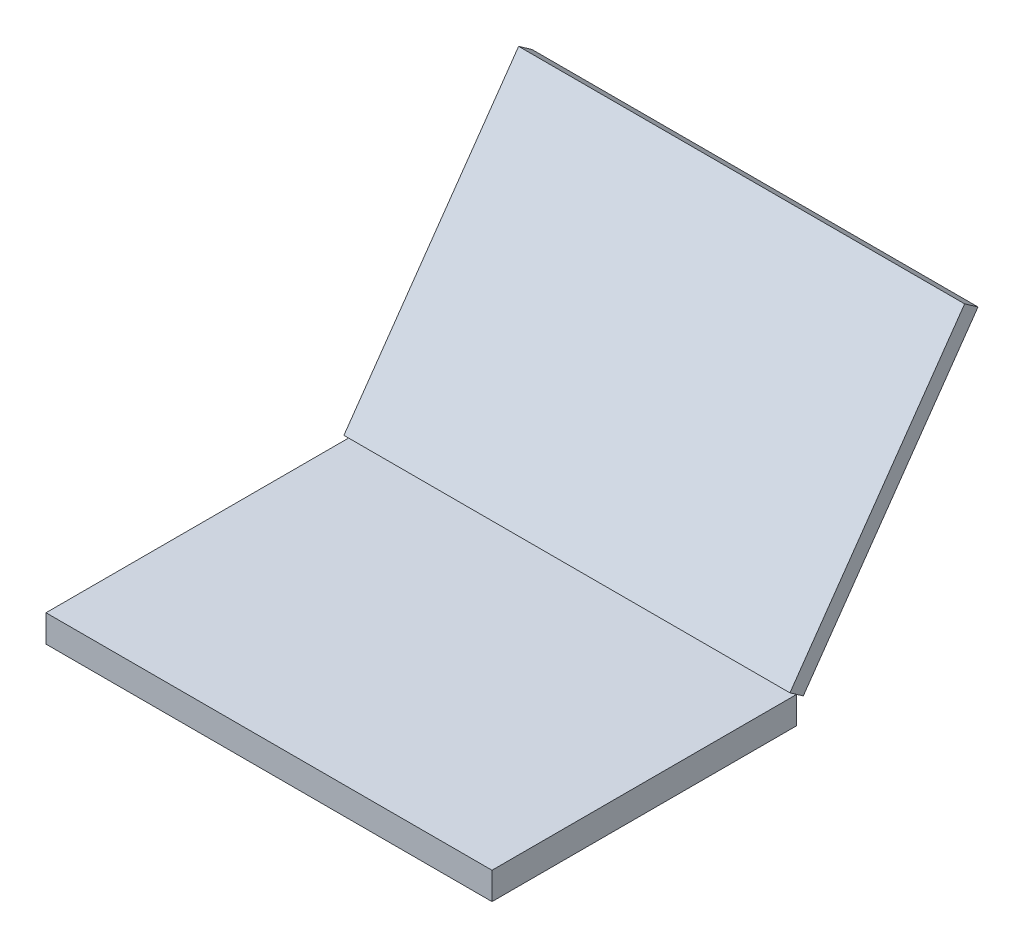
ISO-10303-21;
HEADER;
FILE_DESCRIPTION(('STEP AP214'),'2;1');
FILE_NAME('part.step','',(''),(''),'','','');
FILE_SCHEMA(('AUTOMOTIVE_DESIGN { 1 0 10303 214 1 1 1 1 }'));
ENDSEC;
DATA;
#1=APPLICATION_CONTEXT('core data for automotive mechanical design processes');
#2=APPLICATION_PROTOCOL_DEFINITION('international standard','automotive_design',2000,#1);
#3=PRODUCT_CONTEXT('',#1,'mechanical');
#4=PRODUCT('Part','Part','',(#3));
#5=PRODUCT_RELATED_PRODUCT_CATEGORY('part','',(#4));
#6=PRODUCT_DEFINITION_FORMATION('','',#4);
#7=PRODUCT_DEFINITION_CONTEXT('part definition',#1,'design');
#8=PRODUCT_DEFINITION('design','',#6,#7);
#9=PRODUCT_DEFINITION_SHAPE('','',#8);
#10=(LENGTH_UNIT() NAMED_UNIT(*) SI_UNIT(.MILLI.,.METRE.));
#11=(NAMED_UNIT(*) PLANE_ANGLE_UNIT() SI_UNIT($,.RADIAN.));
#12=(NAMED_UNIT(*) SI_UNIT($,.STERADIAN.) SOLID_ANGLE_UNIT());
#13=UNCERTAINTY_MEASURE_WITH_UNIT(LENGTH_MEASURE(1.E-05),#10,'distance_accuracy_value','');
#14=(GEOMETRIC_REPRESENTATION_CONTEXT(3) GLOBAL_UNCERTAINTY_ASSIGNED_CONTEXT((#13)) GLOBAL_UNIT_ASSIGNED_CONTEXT((#10,
#11,#12)) REPRESENTATION_CONTEXT('',''));
#15=CARTESIAN_POINT('',(0.,0.,0.));
#16=DIRECTION('',(0.,0.,1.));
#17=DIRECTION('',(1.,0.,0.));
#18=AXIS2_PLACEMENT_3D('',#15,#16,#17);
#19=CARTESIAN_POINT('',(-205.,8.1981767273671,-146.143640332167));
#20=DIRECTION('',(1.,0.,0.));
#21=DIRECTION('',(0.,0.,-1.));
#22=AXIS2_PLACEMENT_3D('',#19,#20,#21);
#23=PLANE('',#22);
#24=DIRECTION('',(0.,0.819152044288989,-0.57357643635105));
#25=VECTOR('',#24,1.);
#26=CARTESIAN_POINT('',(-205.,16.8018232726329,-133.856359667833));
#27=LINE('',#26,#25);
#28=CARTESIAN_POINT('',(-205.,16.8018232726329,-133.856359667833));
#29=VERTEX_POINT('',#28);
#30=CARTESIAN_POINT('',(-205.,246.16439567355,-294.457761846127));
#31=VERTEX_POINT('',#30);
#32=EDGE_CURVE('E106',#29,#31,#27,.T.);
#33=ORIENTED_EDGE('',*,*,#32,.T.);
#34=DIRECTION('',(0.,0.57357643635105,0.819152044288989));
#35=VECTOR('',#34,1.);
#36=CARTESIAN_POINT('',(-205.,237.560749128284,-306.745042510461));
#37=LINE('',#36,#35);
#38=CARTESIAN_POINT('',(-205.,237.560749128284,-306.745042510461));
#39=VERTEX_POINT('',#38);
#40=EDGE_CURVE('E12',#39,#31,#37,.T.);
#41=ORIENTED_EDGE('',*,*,#40,.F.);
#42=DIRECTION('',(0.,0.819152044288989,-0.57357643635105));
#43=VECTOR('',#42,1.);
#44=CARTESIAN_POINT('',(-205.,8.1981767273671,-146.143640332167));
#45=LINE('',#44,#43);
#46=CARTESIAN_POINT('',(-205.,8.1981767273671,-146.143640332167));
#47=VERTEX_POINT('',#46);
#48=EDGE_CURVE('E94',#47,#39,#45,.T.);
#49=ORIENTED_EDGE('',*,*,#48,.F.);
#50=DIRECTION('',(0.,0.57357643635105,0.819152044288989));
#51=VECTOR('',#50,1.);
#52=CARTESIAN_POINT('',(-205.,8.1981767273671,-146.143640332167));
#53=LINE('',#52,#51);
#54=EDGE_CURVE('E102',#47,#29,#53,.T.);
#55=ORIENTED_EDGE('',*,*,#54,.T.);
#56=EDGE_LOOP('',(#33,#41,#49,#55));
#57=FACE_BOUND('',#56,.T.);
#58=ADVANCED_FACE('F43',(#57),#23,.F.);
#59=CARTESIAN_POINT('',(-205.,237.560749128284,-306.745042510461));
#60=DIRECTION('',(0.,-0.819152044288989,0.57357643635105));
#61=DIRECTION('',(0.,-0.57357643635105,-0.819152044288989));
#62=AXIS2_PLACEMENT_3D('',#59,#60,#61);
#63=PLANE('',#62);
#64=DIRECTION('',(1.,0.,0.));
#65=VECTOR('',#64,1.);
#66=CARTESIAN_POINT('',(-205.,246.16439567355,-294.457761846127));
#67=LINE('',#66,#65);
#68=CARTESIAN_POINT('',(205.,246.16439567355,-294.457761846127));
#69=VERTEX_POINT('',#68);
#70=EDGE_CURVE('E98',#31,#69,#67,.T.);
#71=ORIENTED_EDGE('',*,*,#70,.T.);
#72=DIRECTION('',(0.,0.57357643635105,0.819152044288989));
#73=VECTOR('',#72,1.);
#74=CARTESIAN_POINT('',(205.,237.560749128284,-306.745042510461));
#75=LINE('',#74,#73);
#76=CARTESIAN_POINT('',(205.,237.560749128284,-306.745042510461));
#77=VERTEX_POINT('',#76);
#78=EDGE_CURVE('E51',#77,#69,#75,.T.);
#79=ORIENTED_EDGE('',*,*,#78,.F.);
#80=DIRECTION('',(1.,0.,0.));
#81=VECTOR('',#80,1.);
#82=CARTESIAN_POINT('',(-205.,237.560749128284,-306.745042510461));
#83=LINE('',#82,#81);
#84=EDGE_CURVE('E89',#39,#77,#83,.T.);
#85=ORIENTED_EDGE('',*,*,#84,.F.);
#86=ORIENTED_EDGE('',*,*,#40,.T.);
#87=EDGE_LOOP('',(#71,#79,#85,#86));
#88=FACE_BOUND('',#87,.T.);
#89=ADVANCED_FACE('F97',(#88),#63,.F.);
#90=CARTESIAN_POINT('',(205.,8.1981767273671,-146.143640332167));
#91=DIRECTION('',(-1.,0.,0.));
#92=DIRECTION('',(0.,-1.,0.));
#93=AXIS2_PLACEMENT_3D('',#90,#91,#92);
#94=PLANE('',#93);
#95=DIRECTION('',(0.,-0.819152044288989,0.57357643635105));
#96=VECTOR('',#95,1.);
#97=CARTESIAN_POINT('',(205.,16.8018232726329,-133.856359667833));
#98=LINE('',#97,#96);
#99=CARTESIAN_POINT('',(205.,16.8018232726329,-133.856359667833));
#100=VERTEX_POINT('',#99);
#101=EDGE_CURVE('E76',#69,#100,#98,.T.);
#102=ORIENTED_EDGE('',*,*,#101,.T.);
#103=DIRECTION('',(0.,0.57357643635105,0.819152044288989));
#104=VECTOR('',#103,1.);
#105=CARTESIAN_POINT('',(205.,8.1981767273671,-146.143640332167));
#106=LINE('',#105,#104);
#107=CARTESIAN_POINT('',(205.,8.1981767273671,-146.143640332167));
#108=VERTEX_POINT('',#107);
#109=EDGE_CURVE('E99',#108,#100,#106,.T.);
#110=ORIENTED_EDGE('',*,*,#109,.F.);
#111=DIRECTION('',(0.,-0.819152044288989,0.57357643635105));
#112=VECTOR('',#111,1.);
#113=CARTESIAN_POINT('',(205.,8.1981767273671,-146.143640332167));
#114=LINE('',#113,#112);
#115=EDGE_CURVE('E92',#77,#108,#114,.T.);
#116=ORIENTED_EDGE('',*,*,#115,.F.);
#117=ORIENTED_EDGE('',*,*,#78,.T.);
#118=EDGE_LOOP('',(#102,#110,#116,#117));
#119=FACE_BOUND('',#118,.T.);
#120=ADVANCED_FACE('F100',(#119),#94,.F.);
#121=CARTESIAN_POINT('',(-205.,8.1981767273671,-146.143640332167));
#122=DIRECTION('',(0.,0.819152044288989,-0.57357643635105));
#123=DIRECTION('',(0.,0.57357643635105,0.819152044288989));
#124=AXIS2_PLACEMENT_3D('',#121,#122,#123);
#125=PLANE('',#124);
#126=DIRECTION('',(-1.,0.,0.));
#127=VECTOR('',#126,1.);
#128=CARTESIAN_POINT('',(-205.,16.8018232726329,-133.856359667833));
#129=LINE('',#128,#127);
#130=EDGE_CURVE('E82',#100,#29,#129,.T.);
#131=ORIENTED_EDGE('',*,*,#130,.T.);
#132=ORIENTED_EDGE('',*,*,#54,.F.);
#133=DIRECTION('',(-1.,0.,0.));
#134=VECTOR('',#133,1.);
#135=CARTESIAN_POINT('',(-205.,8.1981767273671,-146.143640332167));
#136=LINE('',#135,#134);
#137=EDGE_CURVE('E59',#108,#47,#136,.T.);
#138=ORIENTED_EDGE('',*,*,#137,.F.);
#139=ORIENTED_EDGE('',*,*,#109,.T.);
#140=EDGE_LOOP('',(#131,#132,#138,#139));
#141=FACE_BOUND('',#140,.T.);
#142=ADVANCED_FACE('F113',(#141),#125,.F.);
#143=CARTESIAN_POINT('',(0.,-65.9679326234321,-94.2119714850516));
#144=DIRECTION('',(0.,-0.57357643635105,-0.819152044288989));
#145=DIRECTION('',(0.,0.819152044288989,-0.57357643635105));
#146=AXIS2_PLACEMENT_3D('',#143,#144,#145);
#147=PLANE('',#146);
#148=ORIENTED_EDGE('',*,*,#48,.T.);
#149=ORIENTED_EDGE('',*,*,#84,.T.);
#150=ORIENTED_EDGE('',*,*,#115,.T.);
#151=ORIENTED_EDGE('',*,*,#137,.T.);
#152=EDGE_LOOP('',(#148,#149,#150,#151));
#153=FACE_BOUND('',#152,.T.);
#154=ADVANCED_FACE('F90',(#153),#147,.T.);
#155=CARTESIAN_POINT('',(0.,-57.3642860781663,-81.9246908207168));
#156=DIRECTION('',(0.,-0.57357643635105,-0.819152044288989));
#157=DIRECTION('',(0.,0.819152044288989,-0.57357643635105));
#158=AXIS2_PLACEMENT_3D('',#155,#156,#157);
#159=PLANE('',#158);
#160=ORIENTED_EDGE('',*,*,#32,.F.);
#161=ORIENTED_EDGE('',*,*,#130,.F.);
#162=ORIENTED_EDGE('',*,*,#101,.F.);
#163=ORIENTED_EDGE('',*,*,#70,.F.);
#164=EDGE_LOOP('',(#160,#161,#162,#163));
#165=FACE_BOUND('',#164,.T.);
#166=ADVANCED_FACE('F116',(#165),#159,.F.);
#167=CLOSED_SHELL('',(#58,#89,#120,#142,#154,#166));
#168=MANIFOLD_SOLID_BREP('B2',#167);
#169=CARTESIAN_POINT('',(205.,12.5,140.));
#170=DIRECTION('',(-1.,0.,0.));
#171=DIRECTION('',(0.,0.,1.));
#172=AXIS2_PLACEMENT_3D('',#169,#170,#171);
#173=PLANE('',#172);
#174=DIRECTION('',(0.,0.,-1.));
#175=VECTOR('',#174,1.);
#176=CARTESIAN_POINT('',(205.,-12.5,140.));
#177=LINE('',#176,#175);
#178=CARTESIAN_POINT('',(205.,-12.5,140.));
#179=VERTEX_POINT('',#178);
#180=CARTESIAN_POINT('',(205.,-12.5,-140.));
#181=VERTEX_POINT('',#180);
#182=EDGE_CURVE('E230',#179,#181,#177,.T.);
#183=ORIENTED_EDGE('',*,*,#182,.T.);
#184=DIRECTION('',(0.,-1.,0.));
#185=VECTOR('',#184,1.);
#186=CARTESIAN_POINT('',(205.,12.5,-140.));
#187=LINE('',#186,#185);
#188=CARTESIAN_POINT('',(205.,12.5,-140.));
#189=VERTEX_POINT('',#188);
#190=EDGE_CURVE('E41',#189,#181,#187,.T.);
#191=ORIENTED_EDGE('',*,*,#190,.F.);
#192=DIRECTION('',(0.,0.,-1.));
#193=VECTOR('',#192,1.);
#194=CARTESIAN_POINT('',(205.,12.5,140.));
#195=LINE('',#194,#193);
#196=CARTESIAN_POINT('',(205.,12.5,140.));
#197=VERTEX_POINT('',#196);
#198=EDGE_CURVE('E218',#197,#189,#195,.T.);
#199=ORIENTED_EDGE('',*,*,#198,.F.);
#200=DIRECTION('',(0.,-1.,0.));
#201=VECTOR('',#200,1.);
#202=CARTESIAN_POINT('',(205.,12.5,140.));
#203=LINE('',#202,#201);
#204=EDGE_CURVE('E226',#197,#179,#203,.T.);
#205=ORIENTED_EDGE('',*,*,#204,.T.);
#206=EDGE_LOOP('',(#183,#191,#199,#205));
#207=FACE_BOUND('',#206,.T.);
#208=ADVANCED_FACE('F167',(#207),#173,.F.);
#209=CARTESIAN_POINT('',(-205.,12.5,-140.));
#210=DIRECTION('',(0.,0.,1.));
#211=DIRECTION('',(1.,0.,0.));
#212=AXIS2_PLACEMENT_3D('',#209,#210,#211);
#213=PLANE('',#212);
#214=DIRECTION('',(-1.,0.,0.));
#215=VECTOR('',#214,1.);
#216=CARTESIAN_POINT('',(-205.,-12.5,-140.));
#217=LINE('',#216,#215);
#218=CARTESIAN_POINT('',(-205.,-12.5,-140.));
#219=VERTEX_POINT('',#218);
#220=EDGE_CURVE('E222',#181,#219,#217,.T.);
#221=ORIENTED_EDGE('',*,*,#220,.T.);
#222=DIRECTION('',(0.,-1.,0.));
#223=VECTOR('',#222,1.);
#224=CARTESIAN_POINT('',(-205.,12.5,-140.));
#225=LINE('',#224,#223);
#226=CARTESIAN_POINT('',(-205.,12.5,-140.));
#227=VERTEX_POINT('',#226);
#228=EDGE_CURVE('E175',#227,#219,#225,.T.);
#229=ORIENTED_EDGE('',*,*,#228,.F.);
#230=DIRECTION('',(-1.,0.,0.));
#231=VECTOR('',#230,1.);
#232=CARTESIAN_POINT('',(-205.,12.5,-140.));
#233=LINE('',#232,#231);
#234=EDGE_CURVE('E213',#189,#227,#233,.T.);
#235=ORIENTED_EDGE('',*,*,#234,.F.);
#236=ORIENTED_EDGE('',*,*,#190,.T.);
#237=EDGE_LOOP('',(#221,#229,#235,#236));
#238=FACE_BOUND('',#237,.T.);
#239=ADVANCED_FACE('F221',(#238),#213,.F.);
#240=CARTESIAN_POINT('',(-205.,12.5,140.));
#241=DIRECTION('',(1.,0.,0.));
#242=DIRECTION('',(0.,0.,-1.));
#243=AXIS2_PLACEMENT_3D('',#240,#241,#242);
#244=PLANE('',#243);
#245=DIRECTION('',(0.,0.,1.));
#246=VECTOR('',#245,1.);
#247=CARTESIAN_POINT('',(-205.,-12.5,140.));
#248=LINE('',#247,#246);
#249=CARTESIAN_POINT('',(-205.,-12.5,140.));
#250=VERTEX_POINT('',#249);
#251=EDGE_CURVE('E200',#219,#250,#248,.T.);
#252=ORIENTED_EDGE('',*,*,#251,.T.);
#253=DIRECTION('',(0.,-1.,0.));
#254=VECTOR('',#253,1.);
#255=CARTESIAN_POINT('',(-205.,12.5,140.));
#256=LINE('',#255,#254);
#257=CARTESIAN_POINT('',(-205.,12.5,140.));
#258=VERTEX_POINT('',#257);
#259=EDGE_CURVE('E223',#258,#250,#256,.T.);
#260=ORIENTED_EDGE('',*,*,#259,.F.);
#261=DIRECTION('',(0.,0.,1.));
#262=VECTOR('',#261,1.);
#263=CARTESIAN_POINT('',(-205.,12.5,140.));
#264=LINE('',#263,#262);
#265=EDGE_CURVE('E216',#227,#258,#264,.T.);
#266=ORIENTED_EDGE('',*,*,#265,.F.);
#267=ORIENTED_EDGE('',*,*,#228,.T.);
#268=EDGE_LOOP('',(#252,#260,#266,#267));
#269=FACE_BOUND('',#268,.T.);
#270=ADVANCED_FACE('F224',(#269),#244,.F.);
#271=CARTESIAN_POINT('',(-205.,12.5,140.));
#272=DIRECTION('',(0.,0.,-1.));
#273=DIRECTION('',(-1.,0.,0.));
#274=AXIS2_PLACEMENT_3D('',#271,#272,#273);
#275=PLANE('',#274);
#276=DIRECTION('',(1.,0.,0.));
#277=VECTOR('',#276,1.);
#278=CARTESIAN_POINT('',(-205.,-12.5,140.));
#279=LINE('',#278,#277);
#280=EDGE_CURVE('E206',#250,#179,#279,.T.);
#281=ORIENTED_EDGE('',*,*,#280,.T.);
#282=ORIENTED_EDGE('',*,*,#204,.F.);
#283=DIRECTION('',(1.,0.,0.));
#284=VECTOR('',#283,1.);
#285=CARTESIAN_POINT('',(-205.,12.5,140.));
#286=LINE('',#285,#284);
#287=EDGE_CURVE('E183',#258,#197,#286,.T.);
#288=ORIENTED_EDGE('',*,*,#287,.F.);
#289=ORIENTED_EDGE('',*,*,#259,.T.);
#290=EDGE_LOOP('',(#281,#282,#288,#289));
#291=FACE_BOUND('',#290,.T.);
#292=ADVANCED_FACE('F237',(#291),#275,.F.);
#293=CARTESIAN_POINT('',(0.,12.5,0.));
#294=DIRECTION('',(0.,-1.,0.));
#295=DIRECTION('',(0.,0.,-1.));
#296=AXIS2_PLACEMENT_3D('',#293,#294,#295);
#297=PLANE('',#296);
#298=ORIENTED_EDGE('',*,*,#198,.T.);
#299=ORIENTED_EDGE('',*,*,#234,.T.);
#300=ORIENTED_EDGE('',*,*,#265,.T.);
#301=ORIENTED_EDGE('',*,*,#287,.T.);
#302=EDGE_LOOP('',(#298,#299,#300,#301));
#303=FACE_BOUND('',#302,.T.);
#304=ADVANCED_FACE('F214',(#303),#297,.F.);
#305=CARTESIAN_POINT('',(0.,-12.5,0.));
#306=DIRECTION('',(0.,-1.,0.));
#307=DIRECTION('',(0.,0.,-1.));
#308=AXIS2_PLACEMENT_3D('',#305,#306,#307);
#309=PLANE('',#308);
#310=ORIENTED_EDGE('',*,*,#182,.F.);
#311=ORIENTED_EDGE('',*,*,#280,.F.);
#312=ORIENTED_EDGE('',*,*,#251,.F.);
#313=ORIENTED_EDGE('',*,*,#220,.F.);
#314=EDGE_LOOP('',(#310,#311,#312,#313));
#315=FACE_BOUND('',#314,.T.);
#316=ADVANCED_FACE('F240',(#315),#309,.T.);
#317=CLOSED_SHELL('',(#208,#239,#270,#292,#304,#316));
#318=MANIFOLD_SOLID_BREP('B6',#317);
#319=ADVANCED_BREP_SHAPE_REPRESENTATION('',(#18,#168,#318),#14);
#320=SHAPE_DEFINITION_REPRESENTATION(#9,#319);
ENDSEC;
END-ISO-10303-21;
